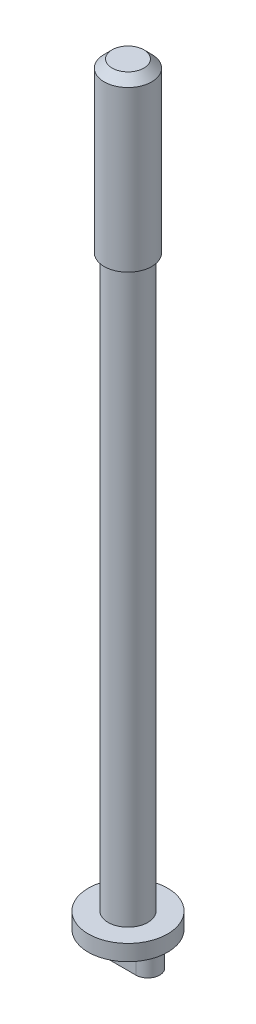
ISO-10303-21;
HEADER;
FILE_DESCRIPTION(('STEP AP214'),'2;1');
FILE_NAME('part.step','',(''),(''),'','','');
FILE_SCHEMA(('AUTOMOTIVE_DESIGN { 1 0 10303 214 1 1 1 1 }'));
ENDSEC;
DATA;
#1=APPLICATION_CONTEXT('core data for automotive mechanical design processes');
#2=APPLICATION_PROTOCOL_DEFINITION('international standard','automotive_design',2000,#1);
#3=PRODUCT_CONTEXT('',#1,'mechanical');
#4=PRODUCT('Part','Part','',(#3));
#5=PRODUCT_RELATED_PRODUCT_CATEGORY('part','',(#4));
#6=PRODUCT_DEFINITION_FORMATION('','',#4);
#7=PRODUCT_DEFINITION_CONTEXT('part definition',#1,'design');
#8=PRODUCT_DEFINITION('design','',#6,#7);
#9=PRODUCT_DEFINITION_SHAPE('','',#8);
#10=(LENGTH_UNIT() NAMED_UNIT(*) SI_UNIT(.MILLI.,.METRE.));
#11=(NAMED_UNIT(*) PLANE_ANGLE_UNIT() SI_UNIT($,.RADIAN.));
#12=(NAMED_UNIT(*) SI_UNIT($,.STERADIAN.) SOLID_ANGLE_UNIT());
#13=UNCERTAINTY_MEASURE_WITH_UNIT(LENGTH_MEASURE(1.E-05),#10,'distance_accuracy_value','');
#14=(GEOMETRIC_REPRESENTATION_CONTEXT(3) GLOBAL_UNCERTAINTY_ASSIGNED_CONTEXT((#13)) GLOBAL_UNIT_ASSIGNED_CONTEXT((#10,
#11,#12)) REPRESENTATION_CONTEXT('',''));
#15=CARTESIAN_POINT('',(0.,0.,0.));
#16=DIRECTION('',(0.,0.,1.));
#17=DIRECTION('',(1.,0.,0.));
#18=AXIS2_PLACEMENT_3D('',#15,#16,#17);
#19=CARTESIAN_POINT('',(-49.9082196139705,-89.7840104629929,0.000144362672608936));
#20=DIRECTION('',(0.,1.,0.));
#21=DIRECTION('',(0.,0.,1.));
#22=AXIS2_PLACEMENT_3D('',#19,#20,#21);
#23=PLANE('',#22);
#24=CARTESIAN_POINT('',(-47.4079596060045,-89.7840104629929,0.));
#25=DIRECTION('',(0.,-1.,0.));
#26=DIRECTION('',(0.,0.,-1.));
#27=AXIS2_PLACEMENT_3D('',#24,#25,#26);
#28=CIRCLE('',#27,1.5);
#29=CARTESIAN_POINT('',(-47.4080080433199,-89.7840104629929,1.49999999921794));
#30=VERTEX_POINT('',#29);
#31=CARTESIAN_POINT('',(-47.4079596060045,-89.7840104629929,-1.5));
#32=VERTEX_POINT('',#31);
#33=EDGE_CURVE('E59',#30,#32,#28,.F.);
#34=ORIENTED_EDGE('',*,*,#33,.F.);
#35=DIRECTION('',(0.999999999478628,0.,3.22915436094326E-05));
#36=VECTOR('',#35,1.);
#37=CARTESIAN_POINT('',(-52.3860001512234,-89.7840104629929,1.49983925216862));
#38=LINE('',#37,#36);
#39=CARTESIAN_POINT('',(-52.4300159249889,-89.7840104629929,1.49983783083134));
#40=VERTEX_POINT('',#39);
#41=EDGE_CURVE('E57',#40,#30,#38,.T.);
#42=ORIENTED_EDGE('',*,*,#41,.F.);
#43=CARTESIAN_POINT('',(-52.4079596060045,-89.7840104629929,0.));
#44=DIRECTION('',(0.,-1.,0.));
#45=DIRECTION('',(0.,0.,-1.));
#46=AXIS2_PLACEMENT_3D('',#43,#44,#45);
#47=CIRCLE('',#46,1.5);
#48=CARTESIAN_POINT('',(-52.4079596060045,-89.7840104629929,-1.5));
#49=VERTEX_POINT('',#48);
#50=EDGE_CURVE('E20',#49,#40,#47,.F.);
#51=ORIENTED_EDGE('',*,*,#50,.F.);
#52=DIRECTION('',(-1.,0.,0.));
#53=VECTOR('',#52,1.);
#54=CARTESIAN_POINT('',(-47.4079596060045,-89.7840104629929,-1.5));
#55=LINE('',#54,#53);
#56=EDGE_CURVE('E68',#32,#49,#55,.T.);
#57=ORIENTED_EDGE('',*,*,#56,.F.);
#58=EDGE_LOOP('',(#34,#42,#51,#57));
#59=FACE_BOUND('',#58,.T.);
#60=ADVANCED_FACE('F16',(#59),#23,.F.);
#61=CARTESIAN_POINT('',(-47.4079596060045,-86.7840104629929,-1.5));
#62=DIRECTION('',(0.,0.,-1.));
#63=DIRECTION('',(-1.,0.,0.));
#64=AXIS2_PLACEMENT_3D('',#61,#62,#63);
#65=PLANE('',#64);
#66=DIRECTION('',(1.,0.,0.));
#67=VECTOR('',#66,1.);
#68=CARTESIAN_POINT('',(-52.4233651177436,-86.7840104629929,-1.5));
#69=LINE('',#68,#67);
#70=CARTESIAN_POINT('',(-47.4079596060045,-86.7840104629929,-1.5));
#71=VERTEX_POINT('',#70);
#72=CARTESIAN_POINT('',(-52.4079596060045,-86.7840104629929,-1.5));
#73=VERTEX_POINT('',#72);
#74=EDGE_CURVE('E99',#71,#73,#69,.F.);
#75=ORIENTED_EDGE('',*,*,#74,.F.);
#76=DIRECTION('',(0.,-1.,0.));
#77=VECTOR('',#76,1.);
#78=CARTESIAN_POINT('',(-47.4079596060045,-86.7840104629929,-1.5));
#79=LINE('',#78,#77);
#80=EDGE_CURVE('E74',#32,#71,#79,.F.);
#81=ORIENTED_EDGE('',*,*,#80,.F.);
#82=ORIENTED_EDGE('',*,*,#56,.T.);
#83=DIRECTION('',(0.,-1.,0.));
#84=VECTOR('',#83,1.);
#85=CARTESIAN_POINT('',(-52.4079596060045,-86.7840104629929,-1.5));
#86=LINE('',#85,#84);
#87=EDGE_CURVE('E62',#73,#49,#86,.T.);
#88=ORIENTED_EDGE('',*,*,#87,.F.);
#89=EDGE_LOOP('',(#75,#81,#82,#88));
#90=FACE_BOUND('',#89,.T.);
#91=ADVANCED_FACE('F196',(#90),#65,.T.);
#92=CARTESIAN_POINT('',(-52.4079596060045,-86.7840104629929,0.));
#93=DIRECTION('',(0.,-1.,0.));
#94=DIRECTION('',(0.,0.,-1.));
#95=AXIS2_PLACEMENT_3D('',#92,#93,#94);
#96=CYLINDRICAL_SURFACE('',#95,1.5);
#97=CARTESIAN_POINT('',(-52.4079596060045,-86.7840104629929,0.));
#98=DIRECTION('',(0.,-1.,0.));
#99=DIRECTION('',(0.,0.,-1.));
#100=AXIS2_PLACEMENT_3D('',#97,#98,#99);
#101=CIRCLE('',#100,1.5);
#102=CARTESIAN_POINT('',(-52.4300159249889,-86.7840104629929,1.49983783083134));
#103=VERTEX_POINT('',#102);
#104=EDGE_CURVE('E98',#73,#103,#101,.F.);
#105=ORIENTED_EDGE('',*,*,#104,.F.);
#106=ORIENTED_EDGE('',*,*,#87,.T.);
#107=ORIENTED_EDGE('',*,*,#50,.T.);
#108=DIRECTION('',(0.,1.,0.));
#109=VECTOR('',#108,1.);
#110=CARTESIAN_POINT('',(-52.4300159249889,-86.7840104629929,1.49983783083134));
#111=LINE('',#110,#109);
#112=EDGE_CURVE('E61',#103,#40,#111,.F.);
#113=ORIENTED_EDGE('',*,*,#112,.F.);
#114=EDGE_LOOP('',(#105,#106,#107,#113));
#115=FACE_BOUND('',#114,.T.);
#116=ADVANCED_FACE('F67',(#115),#96,.T.);
#117=CARTESIAN_POINT('',(-52.3860001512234,-86.7840104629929,1.49983925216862));
#118=DIRECTION('',(-3.22915436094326E-05,0.,0.999999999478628));
#119=DIRECTION('',(0.999999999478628,0.,3.22915436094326E-05));
#120=AXIS2_PLACEMENT_3D('',#117,#118,#119);
#121=PLANE('',#120);
#122=DIRECTION('',(0.999999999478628,0.,3.22915436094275E-05));
#123=VECTOR('',#122,1.);
#124=CARTESIAN_POINT('',(-52.4300159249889,-86.7840104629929,1.49983783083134));
#125=LINE('',#124,#123);
#126=CARTESIAN_POINT('',(-47.4080080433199,-86.7840104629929,1.49999999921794));
#127=VERTEX_POINT('',#126);
#128=EDGE_CURVE('E71',#103,#127,#125,.T.);
#129=ORIENTED_EDGE('',*,*,#128,.F.);
#130=ORIENTED_EDGE('',*,*,#112,.T.);
#131=ORIENTED_EDGE('',*,*,#41,.T.);
#132=DIRECTION('',(0.,-1.,0.));
#133=VECTOR('',#132,1.);
#134=CARTESIAN_POINT('',(-47.4080080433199,-86.7840104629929,1.49999999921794));
#135=LINE('',#134,#133);
#136=EDGE_CURVE('E35',#127,#30,#135,.T.);
#137=ORIENTED_EDGE('',*,*,#136,.F.);
#138=EDGE_LOOP('',(#129,#130,#131,#137));
#139=FACE_BOUND('',#138,.T.);
#140=ADVANCED_FACE('F69',(#139),#121,.T.);
#141=CARTESIAN_POINT('',(-47.4079596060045,-86.7840104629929,0.));
#142=DIRECTION('',(0.,-1.,0.));
#143=DIRECTION('',(0.,0.,-1.));
#144=AXIS2_PLACEMENT_3D('',#141,#142,#143);
#145=CYLINDRICAL_SURFACE('',#144,1.5);
#146=CARTESIAN_POINT('',(-47.4079596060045,-86.7840104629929,0.));
#147=DIRECTION('',(0.,-1.,0.));
#148=DIRECTION('',(0.,0.,-1.));
#149=AXIS2_PLACEMENT_3D('',#146,#147,#148);
#150=CIRCLE('',#149,1.5);
#151=EDGE_CURVE('E95',#127,#71,#150,.F.);
#152=ORIENTED_EDGE('',*,*,#151,.F.);
#153=ORIENTED_EDGE('',*,*,#136,.T.);
#154=ORIENTED_EDGE('',*,*,#33,.T.);
#155=ORIENTED_EDGE('',*,*,#80,.T.);
#156=EDGE_LOOP('',(#152,#153,#154,#155));
#157=FACE_BOUND('',#156,.T.);
#158=ADVANCED_FACE('F109',(#157),#145,.T.);
#159=CARTESIAN_POINT('',(-50.3401825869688,8.21598953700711,0.));
#160=DIRECTION('',(0.,1.,0.));
#161=DIRECTION('',(0.,0.,1.));
#162=AXIS2_PLACEMENT_3D('',#159,#160,#161);
#163=PLANE('',#162);
#164=CARTESIAN_POINT('',(-49.9079596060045,8.21598953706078,0.));
#165=DIRECTION('',(0.,-1.,0.));
#166=DIRECTION('',(0.,0.,-1.));
#167=AXIS2_PLACEMENT_3D('',#164,#165,#166);
#168=CIRCLE('',#167,1.99999999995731);
#169=CARTESIAN_POINT('',(-49.9079596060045,8.21598953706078,-1.99999999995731));
#170=VERTEX_POINT('',#169);
#171=EDGE_CURVE('E92',#170,#170,#168,.T.);
#172=ORIENTED_EDGE('',*,*,#171,.F.);
#173=EDGE_LOOP('',(#172));
#174=FACE_BOUND('',#173,.T.);
#175=ADVANCED_FACE('F114',(#174),#163,.T.);
#176=CARTESIAN_POINT('',(-52.4233651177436,-86.7840104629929,0.));
#177=DIRECTION('',(0.,-1.,0.));
#178=DIRECTION('',(0.,0.,-1.));
#179=AXIS2_PLACEMENT_3D('',#176,#177,#178);
#180=PLANE('',#179);
#181=CARTESIAN_POINT('',(-49.9079596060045,-86.7840104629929,0.));
#182=DIRECTION('',(0.,1.,0.));
#183=DIRECTION('',(0.,0.,1.));
#184=AXIS2_PLACEMENT_3D('',#181,#182,#183);
#185=CIRCLE('',#184,4.99999999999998);
#186=CARTESIAN_POINT('',(-49.9079596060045,-86.7840104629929,4.99999999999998));
#187=VERTEX_POINT('',#186);
#188=EDGE_CURVE('E89',#187,#187,#185,.T.);
#189=ORIENTED_EDGE('',*,*,#188,.F.);
#190=EDGE_LOOP('',(#189));
#191=FACE_BOUND('',#190,.T.);
#192=ORIENTED_EDGE('',*,*,#128,.T.);
#193=ORIENTED_EDGE('',*,*,#151,.T.);
#194=ORIENTED_EDGE('',*,*,#74,.T.);
#195=ORIENTED_EDGE('',*,*,#104,.T.);
#196=EDGE_LOOP('',(#192,#193,#194,#195));
#197=FACE_BOUND('',#196,.T.);
#198=ADVANCED_FACE('F111',(#191,#197),#180,.T.);
#199=CARTESIAN_POINT('',(-49.9079596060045,7.2159895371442,0.));
#200=DIRECTION('',(0.,-1.,0.));
#201=DIRECTION('',(0.,0.,-1.));
#202=AXIS2_PLACEMENT_3D('',#199,#200,#201);
#203=CONICAL_SURFACE('',#202,2.99999999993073,0.78539816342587);
#204=CARTESIAN_POINT('',(-49.9079596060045,7.21598953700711,0.));
#205=DIRECTION('',(0.,1.,0.));
#206=DIRECTION('',(0.,0.,1.));
#207=AXIS2_PLACEMENT_3D('',#204,#205,#206);
#208=CIRCLE('',#207,3.00000000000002);
#209=CARTESIAN_POINT('',(-49.9079596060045,7.21598953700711,3.00000000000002));
#210=VERTEX_POINT('',#209);
#211=EDGE_CURVE('E88',#210,#210,#208,.F.);
#212=ORIENTED_EDGE('',*,*,#211,.F.);
#213=EDGE_LOOP('',(#212));
#214=FACE_BOUND('',#213,.T.);
#215=ORIENTED_EDGE('',*,*,#171,.T.);
#216=EDGE_LOOP('',(#215));
#217=FACE_BOUND('',#216,.T.);
#218=ADVANCED_FACE('F113',(#214,#217),#203,.T.);
#219=CARTESIAN_POINT('',(-49.9079596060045,-85.7840104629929,0.));
#220=DIRECTION('',(0.,1.,0.));
#221=DIRECTION('',(0.,0.,1.));
#222=AXIS2_PLACEMENT_3D('',#219,#220,#221);
#223=CYLINDRICAL_SURFACE('',#222,4.99999999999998);
#224=CARTESIAN_POINT('',(-49.9079596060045,-84.7840104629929,0.));
#225=DIRECTION('',(0.,1.,0.));
#226=DIRECTION('',(0.,0.,1.));
#227=AXIS2_PLACEMENT_3D('',#224,#225,#226);
#228=CIRCLE('',#227,4.99999999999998);
#229=CARTESIAN_POINT('',(-49.9079596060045,-84.7840104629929,4.99999999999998));
#230=VERTEX_POINT('',#229);
#231=EDGE_CURVE('E85',#230,#230,#228,.T.);
#232=ORIENTED_EDGE('',*,*,#231,.F.);
#233=EDGE_LOOP('',(#232));
#234=FACE_BOUND('',#233,.T.);
#235=ORIENTED_EDGE('',*,*,#188,.T.);
#236=EDGE_LOOP('',(#235));
#237=FACE_BOUND('',#236,.T.);
#238=ADVANCED_FACE('F122',(#234,#237),#223,.T.);
#239=CARTESIAN_POINT('',(-49.9079596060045,-2.36239348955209,0.));
#240=DIRECTION('',(0.,1.,0.));
#241=DIRECTION('',(0.,0.,1.));
#242=AXIS2_PLACEMENT_3D('',#239,#240,#241);
#243=CYLINDRICAL_SURFACE('',#242,3.00000000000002);
#244=ORIENTED_EDGE('',*,*,#211,.T.);
#245=EDGE_LOOP('',(#244));
#246=FACE_BOUND('',#245,.T.);
#247=CARTESIAN_POINT('',(-49.9079596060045,-12.9407765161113,0.));
#248=DIRECTION('',(0.,1.,0.));
#249=DIRECTION('',(0.,0.,1.));
#250=AXIS2_PLACEMENT_3D('',#247,#248,#249);
#251=CIRCLE('',#250,3.00000000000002);
#252=CARTESIAN_POINT('',(-49.9079596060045,-12.9407765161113,3.00000000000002));
#253=VERTEX_POINT('',#252);
#254=EDGE_CURVE('E82',#253,#253,#251,.F.);
#255=ORIENTED_EDGE('',*,*,#254,.F.);
#256=EDGE_LOOP('',(#255));
#257=FACE_BOUND('',#256,.T.);
#258=ADVANCED_FACE('F142',(#246,#257),#243,.T.);
#259=CARTESIAN_POINT('',(-53.6579596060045,-84.7840104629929,0.));
#260=DIRECTION('',(0.,1.,0.));
#261=DIRECTION('',(0.,0.,1.));
#262=AXIS2_PLACEMENT_3D('',#259,#260,#261);
#263=PLANE('',#262);
#264=ORIENTED_EDGE('',*,*,#231,.T.);
#265=EDGE_LOOP('',(#264));
#266=FACE_BOUND('',#265,.T.);
#267=CARTESIAN_POINT('',(-49.9079596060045,-84.7840104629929,0.));
#268=DIRECTION('',(0.,1.,0.));
#269=DIRECTION('',(0.,0.,1.));
#270=AXIS2_PLACEMENT_3D('',#267,#268,#269);
#271=CIRCLE('',#270,2.5);
#272=CARTESIAN_POINT('',(-49.9079596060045,-84.7840104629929,2.5));
#273=VERTEX_POINT('',#272);
#274=EDGE_CURVE('E26',#273,#273,#271,.T.);
#275=ORIENTED_EDGE('',*,*,#274,.F.);
#276=EDGE_LOOP('',(#275));
#277=FACE_BOUND('',#276,.T.);
#278=ADVANCED_FACE('F134',(#266,#277),#263,.T.);
#279=CARTESIAN_POINT('',(-52.6579596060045,-12.9407765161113,0.));
#280=DIRECTION('',(0.,-1.,0.));
#281=DIRECTION('',(0.,0.,-1.));
#282=AXIS2_PLACEMENT_3D('',#279,#280,#281);
#283=PLANE('',#282);
#284=CARTESIAN_POINT('',(-49.9079596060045,-12.9407765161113,0.));
#285=DIRECTION('',(0.,1.,0.));
#286=DIRECTION('',(0.,0.,1.));
#287=AXIS2_PLACEMENT_3D('',#284,#285,#286);
#288=CIRCLE('',#287,2.5);
#289=CARTESIAN_POINT('',(-49.9079596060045,-12.9407765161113,2.5));
#290=VERTEX_POINT('',#289);
#291=EDGE_CURVE('E10',#290,#290,#288,.F.);
#292=ORIENTED_EDGE('',*,*,#291,.F.);
#293=EDGE_LOOP('',(#292));
#294=FACE_BOUND('',#293,.T.);
#295=ORIENTED_EDGE('',*,*,#254,.T.);
#296=EDGE_LOOP('',(#295));
#297=FACE_BOUND('',#296,.T.);
#298=ADVANCED_FACE('F129',(#294,#297),#283,.T.);
#299=CARTESIAN_POINT('',(-49.9079596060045,-48.8623934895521,0.));
#300=DIRECTION('',(0.,1.,0.));
#301=DIRECTION('',(0.,0.,1.));
#302=AXIS2_PLACEMENT_3D('',#299,#300,#301);
#303=CYLINDRICAL_SURFACE('',#302,2.5);
#304=ORIENTED_EDGE('',*,*,#274,.T.);
#305=EDGE_LOOP('',(#304));
#306=FACE_BOUND('',#305,.T.);
#307=ORIENTED_EDGE('',*,*,#291,.T.);
#308=EDGE_LOOP('',(#307));
#309=FACE_BOUND('',#308,.T.);
#310=ADVANCED_FACE('F18',(#306,#309),#303,.T.);
#311=CLOSED_SHELL('',(#60,#91,#116,#140,#158,#175,#198,#218,#238,#258,#278,#298,#310));
#312=MANIFOLD_SOLID_BREP('B1',#311);
#313=ADVANCED_BREP_SHAPE_REPRESENTATION('',(#18,#312),#14);
#314=SHAPE_DEFINITION_REPRESENTATION(#9,#313);
ENDSEC;
END-ISO-10303-21;
